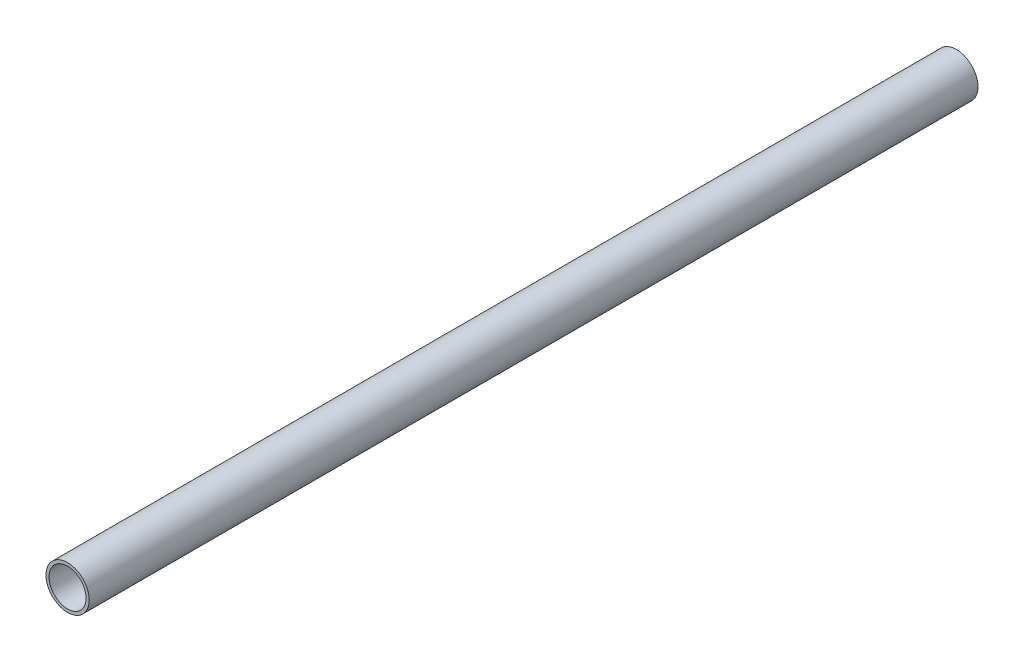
ISO-10303-21;
HEADER;
FILE_DESCRIPTION(('STEP AP214'),'2;1');
FILE_NAME('part.step','',(''),(''),'','','');
FILE_SCHEMA(('AUTOMOTIVE_DESIGN { 1 0 10303 214 1 1 1 1 }'));
ENDSEC;
DATA;
#1=APPLICATION_CONTEXT('core data for automotive mechanical design processes');
#2=APPLICATION_PROTOCOL_DEFINITION('international standard','automotive_design',2000,#1);
#3=PRODUCT_CONTEXT('',#1,'mechanical');
#4=PRODUCT('Part','Part','',(#3));
#5=PRODUCT_RELATED_PRODUCT_CATEGORY('part','',(#4));
#6=PRODUCT_DEFINITION_FORMATION('','',#4);
#7=PRODUCT_DEFINITION_CONTEXT('part definition',#1,'design');
#8=PRODUCT_DEFINITION('design','',#6,#7);
#9=PRODUCT_DEFINITION_SHAPE('','',#8);
#10=(LENGTH_UNIT() NAMED_UNIT(*) SI_UNIT(.MILLI.,.METRE.));
#11=(NAMED_UNIT(*) PLANE_ANGLE_UNIT() SI_UNIT($,.RADIAN.));
#12=(NAMED_UNIT(*) SI_UNIT($,.STERADIAN.) SOLID_ANGLE_UNIT());
#13=UNCERTAINTY_MEASURE_WITH_UNIT(LENGTH_MEASURE(1.E-05),#10,'distance_accuracy_value','');
#14=(GEOMETRIC_REPRESENTATION_CONTEXT(3) GLOBAL_UNCERTAINTY_ASSIGNED_CONTEXT((#13)) GLOBAL_UNIT_ASSIGNED_CONTEXT((#10,
#11,#12)) REPRESENTATION_CONTEXT('',''));
#15=CARTESIAN_POINT('',(0.,0.,0.));
#16=DIRECTION('',(0.,0.,1.));
#17=DIRECTION('',(1.,0.,0.));
#18=AXIS2_PLACEMENT_3D('',#15,#16,#17);
#19=CARTESIAN_POINT('',(0.,0.,-457.2));
#20=DIRECTION('',(0.,0.,1.));
#21=DIRECTION('',(1.,0.,0.));
#22=AXIS2_PLACEMENT_3D('',#19,#20,#21);
#23=CYLINDRICAL_SURFACE('',#22,11.1125);
#24=CARTESIAN_POINT('',(0.,0.,-457.2));
#25=DIRECTION('',(0.,0.,1.));
#26=DIRECTION('',(1.,0.,0.));
#27=AXIS2_PLACEMENT_3D('',#24,#25,#26);
#28=CIRCLE('',#27,11.1125);
#29=CARTESIAN_POINT('',(11.1125,0.,-457.2));
#30=VERTEX_POINT('',#29);
#31=EDGE_CURVE('E10',#30,#30,#28,.T.);
#32=ORIENTED_EDGE('',*,*,#31,.T.);
#33=EDGE_LOOP('',(#32));
#34=FACE_BOUND('',#33,.T.);
#35=CARTESIAN_POINT('',(0.,0.,0.));
#36=DIRECTION('',(0.,0.,1.));
#37=DIRECTION('',(1.,0.,0.));
#38=AXIS2_PLACEMENT_3D('',#35,#36,#37);
#39=CIRCLE('',#38,11.1125);
#40=CARTESIAN_POINT('',(11.1125,0.,0.));
#41=VERTEX_POINT('',#40);
#42=EDGE_CURVE('E33',#41,#41,#39,.T.);
#43=ORIENTED_EDGE('',*,*,#42,.F.);
#44=EDGE_LOOP('',(#43));
#45=FACE_BOUND('',#44,.T.);
#46=ADVANCED_FACE('F27',(#34,#45),#23,.T.);
#47=CARTESIAN_POINT('',(0.,0.,-457.2));
#48=DIRECTION('',(0.,0.,1.));
#49=DIRECTION('',(1.,0.,0.));
#50=AXIS2_PLACEMENT_3D('',#47,#48,#49);
#51=PLANE('',#50);
#52=CARTESIAN_POINT('',(0.,0.,-457.2));
#53=DIRECTION('',(0.,0.,1.));
#54=DIRECTION('',(1.,0.,0.));
#55=AXIS2_PLACEMENT_3D('',#52,#53,#54);
#56=CIRCLE('',#55,9.525);
#57=CARTESIAN_POINT('',(9.525,0.,-457.2));
#58=VERTEX_POINT('',#57);
#59=EDGE_CURVE('E37',#58,#58,#56,.T.);
#60=ORIENTED_EDGE('',*,*,#59,.T.);
#61=EDGE_LOOP('',(#60));
#62=FACE_BOUND('',#61,.T.);
#63=ORIENTED_EDGE('',*,*,#31,.F.);
#64=EDGE_LOOP('',(#63));
#65=FACE_BOUND('',#64,.T.);
#66=ADVANCED_FACE('F51',(#62,#65),#51,.F.);
#67=CARTESIAN_POINT('',(0.,0.,0.));
#68=DIRECTION('',(0.,0.,1.));
#69=DIRECTION('',(1.,0.,0.));
#70=AXIS2_PLACEMENT_3D('',#67,#68,#69);
#71=PLANE('',#70);
#72=CARTESIAN_POINT('',(0.,0.,0.));
#73=DIRECTION('',(0.,0.,1.));
#74=DIRECTION('',(1.,0.,0.));
#75=AXIS2_PLACEMENT_3D('',#72,#73,#74);
#76=CIRCLE('',#75,9.525);
#77=CARTESIAN_POINT('',(9.525,0.,0.));
#78=VERTEX_POINT('',#77);
#79=EDGE_CURVE('E41',#78,#78,#76,.T.);
#80=ORIENTED_EDGE('',*,*,#79,.F.);
#81=EDGE_LOOP('',(#80));
#82=FACE_BOUND('',#81,.T.);
#83=ORIENTED_EDGE('',*,*,#42,.T.);
#84=EDGE_LOOP('',(#83));
#85=FACE_BOUND('',#84,.T.);
#86=ADVANCED_FACE('F49',(#82,#85),#71,.T.);
#87=CARTESIAN_POINT('',(0.,0.,-457.2));
#88=DIRECTION('',(0.,0.,1.));
#89=DIRECTION('',(1.,0.,0.));
#90=AXIS2_PLACEMENT_3D('',#87,#88,#89);
#91=CYLINDRICAL_SURFACE('',#90,9.525);
#92=ORIENTED_EDGE('',*,*,#59,.F.);
#93=EDGE_LOOP('',(#92));
#94=FACE_BOUND('',#93,.T.);
#95=ORIENTED_EDGE('',*,*,#79,.T.);
#96=EDGE_LOOP('',(#95));
#97=FACE_BOUND('',#96,.T.);
#98=ADVANCED_FACE('F47',(#94,#97),#91,.F.);
#99=CLOSED_SHELL('',(#46,#66,#86,#98));
#100=MANIFOLD_SOLID_BREP('B2',#99);
#101=ADVANCED_BREP_SHAPE_REPRESENTATION('',(#18,#100),#14);
#102=SHAPE_DEFINITION_REPRESENTATION(#9,#101);
ENDSEC;
END-ISO-10303-21;
